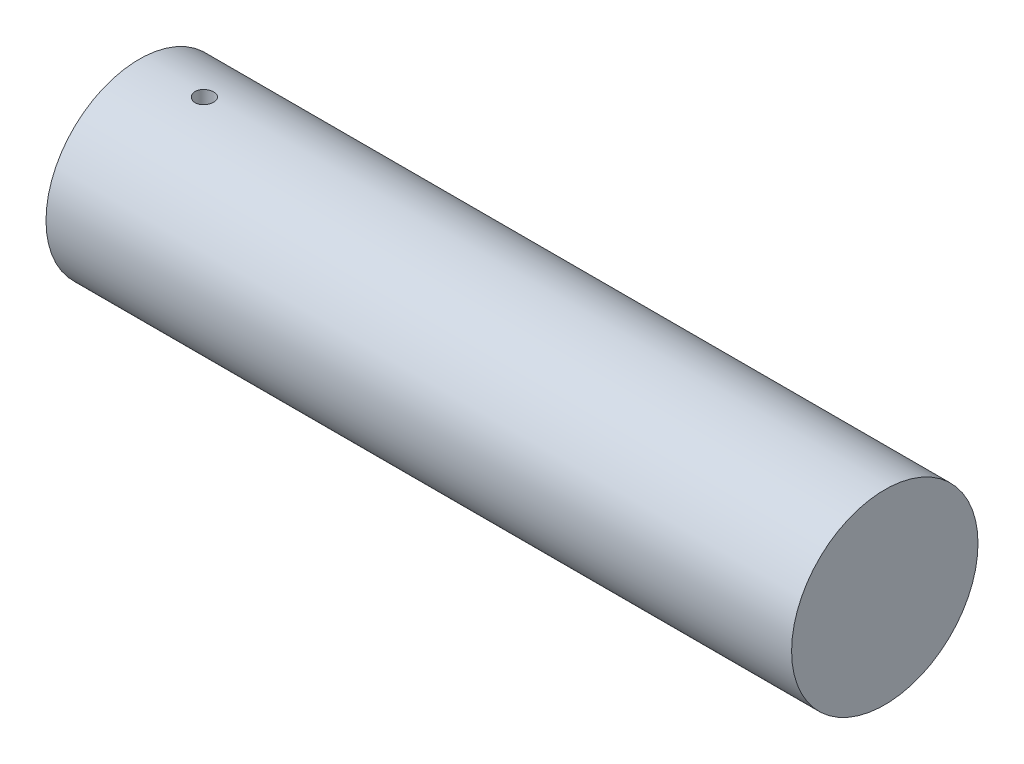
ISO-10303-21;
HEADER;
FILE_DESCRIPTION(('STEP AP214'),'2;1');
FILE_NAME('part.step','',(''),(''),'','','');
FILE_SCHEMA(('AUTOMOTIVE_DESIGN { 1 0 10303 214 1 1 1 1 }'));
ENDSEC;
DATA;
#1=APPLICATION_CONTEXT('core data for automotive mechanical design processes');
#2=APPLICATION_PROTOCOL_DEFINITION('international standard','automotive_design',2000,#1);
#3=PRODUCT_CONTEXT('',#1,'mechanical');
#4=PRODUCT('Part','Part','',(#3));
#5=PRODUCT_RELATED_PRODUCT_CATEGORY('part','',(#4));
#6=PRODUCT_DEFINITION_FORMATION('','',#4);
#7=PRODUCT_DEFINITION_CONTEXT('part definition',#1,'design');
#8=PRODUCT_DEFINITION('design','',#6,#7);
#9=PRODUCT_DEFINITION_SHAPE('','',#8);
#10=(LENGTH_UNIT() NAMED_UNIT(*) SI_UNIT(.MILLI.,.METRE.));
#11=(NAMED_UNIT(*) PLANE_ANGLE_UNIT() SI_UNIT($,.RADIAN.));
#12=(NAMED_UNIT(*) SI_UNIT($,.STERADIAN.) SOLID_ANGLE_UNIT());
#13=UNCERTAINTY_MEASURE_WITH_UNIT(LENGTH_MEASURE(1.E-05),#10,'distance_accuracy_value','');
#14=(GEOMETRIC_REPRESENTATION_CONTEXT(3) GLOBAL_UNCERTAINTY_ASSIGNED_CONTEXT((#13)) GLOBAL_UNIT_ASSIGNED_CONTEXT((#10,
#11,#12)) REPRESENTATION_CONTEXT('',''));
#15=CARTESIAN_POINT('',(0.,0.,0.));
#16=DIRECTION('',(0.,0.,1.));
#17=DIRECTION('',(1.,0.,0.));
#18=AXIS2_PLACEMENT_3D('',#15,#16,#17);
#19=CARTESIAN_POINT('',(3.5,-20.,0.));
#20=DIRECTION('',(0.,1.,0.));
#21=DIRECTION('',(0.,0.,1.));
#22=AXIS2_PLACEMENT_3D('',#19,#20,#21);
#23=CYLINDRICAL_SURFACE('',#22,0.500000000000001);
#24=CARTESIAN_POINT('',(3.5,-1.14564392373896,0.500000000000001));
#25=CARTESIAN_POINT('',(3.52678487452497,-1.14564662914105,0.499997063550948));
#26=CARTESIAN_POINT('',(3.55360763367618,-1.14659650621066,0.497834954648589));
#27=CARTESIAN_POINT('',(3.60648370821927,-1.15027728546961,0.489267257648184));
#28=CARTESIAN_POINT('',(3.63253487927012,-1.15301273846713,0.482850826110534));
#29=CARTESIAN_POINT('',(3.68301323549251,-1.15990113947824,0.466058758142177));
#30=CARTESIAN_POINT('',(3.70744613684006,-1.16404874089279,0.455698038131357));
#31=CARTESIAN_POINT('',(3.7542212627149,-1.1732866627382,0.431355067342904));
#32=CARTESIAN_POINT('',(3.77656394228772,-1.17837677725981,0.417373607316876));
#33=CARTESIAN_POINT('',(3.81981510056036,-1.18925216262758,0.385330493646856));
#34=CARTESIAN_POINT('',(3.84058910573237,-1.19505979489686,0.367094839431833));
#35=CARTESIAN_POINT('',(3.87888224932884,-1.20653114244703,0.327427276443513));
#36=CARTESIAN_POINT('',(3.89640025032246,-1.21219480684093,0.305994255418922));
#37=CARTESIAN_POINT('',(3.92835159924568,-1.22300851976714,0.259501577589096));
#38=CARTESIAN_POINT('',(3.94263607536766,-1.22812950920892,0.234332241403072));
#39=CARTESIAN_POINT('',(3.96671089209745,-1.23700981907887,0.181706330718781));
#40=CARTESIAN_POINT('',(3.97650306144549,-1.24076969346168,0.154250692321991));
#41=CARTESIAN_POINT('',(3.99083537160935,-1.24634581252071,0.0992416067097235));
#42=CARTESIAN_POINT('',(3.99560682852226,-1.24824734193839,0.0717572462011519));
#43=CARTESIAN_POINT('',(4.00050712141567,-1.25020077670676,0.0163165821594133));
#44=CARTESIAN_POINT('',(4.00063768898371,-1.25025337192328,-0.0116395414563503));
#45=CARTESIAN_POINT('',(3.99637930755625,-1.24855490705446,-0.0655581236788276));
#46=CARTESIAN_POINT('',(3.99224380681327,-1.24690499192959,-0.0915443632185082));
#47=CARTESIAN_POINT('',(3.98000178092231,-1.24212322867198,-0.142418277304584));
#48=CARTESIAN_POINT('',(3.9718949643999,-1.23899127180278,-0.16730587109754));
#49=CARTESIAN_POINT('',(3.95184087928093,-1.23149206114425,-0.215724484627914));
#50=CARTESIAN_POINT('',(3.93983757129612,-1.227106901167,-0.239229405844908));
#51=CARTESIAN_POINT('',(3.91238374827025,-1.21753646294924,-0.283952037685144));
#52=CARTESIAN_POINT('',(3.8969320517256,-1.21235091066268,-0.305168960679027));
#53=CARTESIAN_POINT('',(3.86183771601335,-1.20130409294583,-0.346192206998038));
#54=CARTESIAN_POINT('',(3.84198652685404,-1.1954208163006,-0.365814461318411));
#55=CARTESIAN_POINT('',(3.79925235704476,-1.18390415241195,-0.401526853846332));
#56=CARTESIAN_POINT('',(3.77636838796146,-1.17827084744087,-0.417615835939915));
#57=CARTESIAN_POINT('',(3.72739524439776,-1.16774224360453,-0.446226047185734));
#58=CARTESIAN_POINT('',(3.70123379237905,-1.16287228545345,-0.458633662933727));
#59=CARTESIAN_POINT('',(3.6469461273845,-1.15471897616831,-0.478794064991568));
#60=CARTESIAN_POINT('',(3.61882120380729,-1.15143459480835,-0.486549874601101));
#61=CARTESIAN_POINT('',(3.56324105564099,-1.14707439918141,-0.496738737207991));
#62=CARTESIAN_POINT('',(3.53584988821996,-1.14587591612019,-0.499468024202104));
#63=CARTESIAN_POINT('',(3.48098069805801,-1.14547374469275,-0.500390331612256));
#64=CARTESIAN_POINT('',(3.45350270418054,-1.14626945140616,-0.498584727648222));
#65=CARTESIAN_POINT('',(3.40088526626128,-1.14964011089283,-0.490758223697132));
#66=CARTESIAN_POINT('',(3.37570176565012,-1.15211114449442,-0.484983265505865));
#67=CARTESIAN_POINT('',(3.3266778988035,-1.15842512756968,-0.46970104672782));
#68=CARTESIAN_POINT('',(3.30283783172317,-1.16226838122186,-0.460192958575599));
#69=CARTESIAN_POINT('',(3.25609941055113,-1.17108445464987,-0.437283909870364));
#70=CARTESIAN_POINT('',(3.23327845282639,-1.17609676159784,-0.42374071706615));
#71=CARTESIAN_POINT('',(3.19012925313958,-1.18662596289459,-0.39329130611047));
#72=CARTESIAN_POINT('',(3.1698020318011,-1.19214306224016,-0.376383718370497));
#73=CARTESIAN_POINT('',(3.1306566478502,-1.20355228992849,-0.338211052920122));
#74=CARTESIAN_POINT('',(3.11206085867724,-1.20944201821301,-0.316716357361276));
#75=CARTESIAN_POINT('',(3.07870573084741,-1.22054948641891,-0.270770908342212));
#76=CARTESIAN_POINT('',(3.06394654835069,-1.2257671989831,-0.246320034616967));
#77=CARTESIAN_POINT('',(3.03873809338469,-1.23495928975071,-0.195069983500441));
#78=CARTESIAN_POINT('',(3.02828778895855,-1.23893396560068,-0.168271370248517));
#79=CARTESIAN_POINT('',(3.01211278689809,-1.24518178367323,-0.113098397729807));
#80=CARTESIAN_POINT('',(3.00638552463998,-1.24745584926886,-0.0847249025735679));
#81=CARTESIAN_POINT('',(3.00012382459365,-1.24994752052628,-0.0292041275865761));
#82=CARTESIAN_POINT('',(2.99927496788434,-1.25028961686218,-0.00209762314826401));
#83=CARTESIAN_POINT('',(3.00196386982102,-1.24921510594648,0.0518584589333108));
#84=CARTESIAN_POINT('',(3.0055009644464,-1.24779876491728,0.0787080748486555));
#85=CARTESIAN_POINT('',(3.01663669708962,-1.24342878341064,0.130542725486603));
#86=CARTESIAN_POINT('',(3.02410723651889,-1.24052370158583,0.155559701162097));
#87=CARTESIAN_POINT('',(3.04276320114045,-1.23348736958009,0.203980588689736));
#88=CARTESIAN_POINT('',(3.05394931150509,-1.22935589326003,0.227384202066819));
#89=CARTESIAN_POINT('',(3.08027579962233,-1.22004523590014,0.273050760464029));
#90=CARTESIAN_POINT('',(3.09556907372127,-1.21482782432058,0.295217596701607));
#91=CARTESIAN_POINT('',(3.12944712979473,-1.20397350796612,0.336763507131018));
#92=CARTESIAN_POINT('',(3.14803327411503,-1.19833643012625,0.356141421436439));
#93=CARTESIAN_POINT('',(3.18932880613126,-1.18684440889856,0.392800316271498));
#94=CARTESIAN_POINT('',(3.21222221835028,-1.18099758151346,0.409877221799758));
#95=CARTESIAN_POINT('',(3.26073553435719,-1.17012417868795,0.43996186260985));
#96=CARTESIAN_POINT('',(3.28635575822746,-1.16509769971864,0.452969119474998));
#97=CARTESIAN_POINT('',(3.33725930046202,-1.15689716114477,0.473497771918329));
#98=CARTESIAN_POINT('',(3.36236630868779,-1.15359729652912,0.481406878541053));
#99=CARTESIAN_POINT('',(3.41362135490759,-1.14861500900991,0.493179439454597));
#100=CARTESIAN_POINT('',(3.43976627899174,-1.14692808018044,0.497054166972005));
#101=CARTESIAN_POINT('',(3.47734439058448,-1.14581114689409,0.499616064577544));
#102=CARTESIAN_POINT('',(3.4886688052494,-1.14564277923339,0.500001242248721));
#103=CARTESIAN_POINT('',(3.5,-1.14564392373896,0.500000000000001));
#104=B_SPLINE_CURVE_WITH_KNOTS('',3,(#24,#25,#26,#27,#28,#29,#30,#31,#32,#33,#34,#35,#36,#37,
#38,#39,#40,#41,#42,#43,#44,#45,#46,#47,#48,#49,#50,#51,#52,#53,#54,#55,#56,#57,#58,#59,#60,#61,
#62,#63,#64,#65,#66,#67,#68,#69,#70,#71,#72,#73,#74,#75,#76,#77,#78,#79,#80,#81,#82,#83,#84,#85,
#86,#87,#88,#89,#90,#91,#92,#93,#94,#95,#96,#97,#98,#99,#100,#101,#102,#103),.UNSPECIFIED.,.T.,
.F.,(4,2,2,2,2,2,2,2,2,2,2,2,2,2,2,2,2,2,2,2,2,2,2,2,2,2,2,2,2,2,2,2,2,2,2,2,2,2,2,4),(0.,
0.0803194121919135,0.160844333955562,0.241067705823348,0.321273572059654,0.405639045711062,
0.490033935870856,0.577756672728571,0.665443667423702,0.74888545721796,0.832296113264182,
0.911021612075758,0.989752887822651,1.06967075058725,1.14961603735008,1.23481011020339,
1.32003201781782,1.40766114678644,1.49523326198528,1.57745536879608,1.65965253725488,
1.73716812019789,1.81470089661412,1.89537788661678,1.97608778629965,2.06275933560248,
2.1494344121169,2.23608871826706,2.32269593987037,2.40365259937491,2.48459700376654,
2.56305498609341,2.64152744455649,2.72346762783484,2.80544179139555,2.89249063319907,
2.979549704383,3.05879165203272,3.13781157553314,3.17179026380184),.UNSPECIFIED.);
#105=CARTESIAN_POINT('',(3.5,-1.14564392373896,0.500000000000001));
#106=VERTEX_POINT('',#105);
#107=EDGE_CURVE('E40',#106,#106,#104,.T.);
#108=ORIENTED_EDGE('',*,*,#107,.T.);
#109=EDGE_LOOP('',(#108));
#110=FACE_BOUND('',#109,.T.);
#111=CARTESIAN_POINT('',(3.5,-4.9749371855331,0.500000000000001));
#112=CARTESIAN_POINT('',(3.5280097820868,-4.97493751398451,0.499998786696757));
#113=CARTESIAN_POINT('',(3.55603808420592,-4.97517628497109,0.497638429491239));
#114=CARTESIAN_POINT('',(3.61131759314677,-4.9761054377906,0.488258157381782));
#115=CARTESIAN_POINT('',(3.63856790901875,-4.9767963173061,0.481233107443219));
#116=CARTESIAN_POINT('',(3.69148290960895,-4.97855066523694,0.462730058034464));
#117=CARTESIAN_POINT('',(3.71714854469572,-4.97961390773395,0.45125475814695));
#118=CARTESIAN_POINT('',(3.76618389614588,-4.9819929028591,0.424182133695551));
#119=CARTESIAN_POINT('',(3.78955406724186,-4.98330860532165,0.408585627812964));
#120=CARTESIAN_POINT('',(3.83342563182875,-4.98604963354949,0.373652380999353));
#121=CARTESIAN_POINT('',(3.85391750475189,-4.98747530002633,0.35430370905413));
#122=CARTESIAN_POINT('',(3.89136880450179,-4.99027252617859,0.312440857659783));
#123=CARTESIAN_POINT('',(3.90832806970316,-4.99164408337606,0.289926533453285));
#124=CARTESIAN_POINT('',(3.93826562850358,-4.99418191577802,0.242313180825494));
#125=CARTESIAN_POINT('',(3.95123549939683,-4.99534775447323,0.217208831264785));
#126=CARTESIAN_POINT('',(3.97277221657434,-4.99733908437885,0.165164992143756));
#127=CARTESIAN_POINT('',(3.98133917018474,-4.99816458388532,0.13822554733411));
#128=CARTESIAN_POINT('',(3.99379895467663,-4.99937983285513,0.0833723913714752));
#129=CARTESIAN_POINT('',(3.99770741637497,-4.99977103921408,0.055462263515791));
#130=CARTESIAN_POINT('',(4.00078763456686,-5.00007857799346,-0.000620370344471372));
#131=CARTESIAN_POINT('',(3.99995951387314,-4.99999492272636,-0.0287928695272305));
#132=CARTESIAN_POINT('',(3.99360276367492,-4.99936335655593,-0.0844944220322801));
#133=CARTESIAN_POINT('',(3.98809094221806,-4.99881710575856,-0.11202541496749));
#134=CARTESIAN_POINT('',(3.97254943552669,-4.99732364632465,-0.165769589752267));
#135=CARTESIAN_POINT('',(3.96251969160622,-4.99637643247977,-0.191982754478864));
#136=CARTESIAN_POINT('',(3.93820861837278,-4.99418468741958,-0.242400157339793));
#137=CARTESIAN_POINT('',(3.92391985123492,-4.99293963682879,-0.266600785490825));
#138=CARTESIAN_POINT('',(3.89150173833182,-4.99029192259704,-0.312266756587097));
#139=CARTESIAN_POINT('',(3.87337227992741,-4.98888925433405,-0.333732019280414));
#140=CARTESIAN_POINT('',(3.83369288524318,-4.98607646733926,-0.373416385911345));
#141=CARTESIAN_POINT('',(3.81212832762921,-4.98466634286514,-0.391620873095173));
#142=CARTESIAN_POINT('',(3.76624156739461,-4.98200369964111,-0.42415376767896));
#143=CARTESIAN_POINT('',(3.74191936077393,-4.98075118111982,-0.438482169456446));
#144=CARTESIAN_POINT('',(3.69119648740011,-4.97854544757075,-0.462856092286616));
#145=CARTESIAN_POINT('',(3.66479538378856,-4.97759229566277,-0.472900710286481));
#146=CARTESIAN_POINT('',(3.61066969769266,-4.97609450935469,-0.488410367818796));
#147=CARTESIAN_POINT('',(3.58294515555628,-4.97554986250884,-0.493875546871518));
#148=CARTESIAN_POINT('',(3.52708791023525,-4.97493290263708,-0.500052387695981));
#149=CARTESIAN_POINT('',(3.49895748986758,-4.97485855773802,-0.500784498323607));
#150=CARTESIAN_POINT('',(3.44297436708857,-4.97518525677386,-0.497528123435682));
#151=CARTESIAN_POINT('',(3.41512166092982,-4.97558629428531,-0.493539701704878));
#152=CARTESIAN_POINT('',(3.36054420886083,-4.97681672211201,-0.480972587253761));
#153=CARTESIAN_POINT('',(3.33381721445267,-4.97764521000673,-0.472403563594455));
#154=CARTESIAN_POINT('',(3.28217997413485,-4.97963645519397,-0.45092835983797));
#155=CARTESIAN_POINT('',(3.25726976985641,-4.98079922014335,-0.438022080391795));
#156=CARTESIAN_POINT('',(3.20988001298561,-4.98333292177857,-0.408187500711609));
#157=CARTESIAN_POINT('',(3.18740902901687,-4.98470455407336,-0.391245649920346));
#158=CARTESIAN_POINT('',(3.14562247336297,-4.98749916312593,-0.353840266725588));
#159=CARTESIAN_POINT('',(3.12630697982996,-4.98892214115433,-0.333376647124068));
#160=CARTESIAN_POINT('',(3.09130918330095,-4.99166523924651,-0.289419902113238));
#161=CARTESIAN_POINT('',(3.07564022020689,-4.99298497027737,-0.265916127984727));
#162=CARTESIAN_POINT('',(3.04847206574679,-4.99536721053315,-0.216598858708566));
#163=CARTESIAN_POINT('',(3.03697281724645,-4.99642972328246,-0.190785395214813));
#164=CARTESIAN_POINT('',(3.01849311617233,-4.99817605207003,-0.137628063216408));
#165=CARTESIAN_POINT('',(3.01150460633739,-4.99886054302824,-0.11028701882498));
#166=CARTESIAN_POINT('',(3.00221846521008,-4.99977647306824,-0.0548124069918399));
#167=CARTESIAN_POINT('',(2.99992070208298,-5.00000792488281,-0.0266788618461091));
#168=CARTESIAN_POINT('',(3.00008313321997,-4.99999169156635,0.0294511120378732));
#169=CARTESIAN_POINT('',(3.00252261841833,-4.99974609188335,0.0574476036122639));
#170=CARTESIAN_POINT('',(3.01204687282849,-4.99880746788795,0.112630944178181));
#171=CARTESIAN_POINT('',(3.01913164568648,-4.99811444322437,0.139817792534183));
#172=CARTESIAN_POINT('',(3.03773962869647,-4.99635861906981,0.192609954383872));
#173=CARTESIAN_POINT('',(3.04926223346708,-4.99529587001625,0.218215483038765));
#174=CARTESIAN_POINT('',(3.07641658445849,-4.99291906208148,0.267132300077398));
#175=CARTESIAN_POINT('',(3.09204830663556,-4.99160500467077,0.29044360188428));
#176=CARTESIAN_POINT('',(3.12705480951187,-4.98886592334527,0.33421636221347));
#177=CARTESIAN_POINT('',(3.1464450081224,-4.9874404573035,0.354665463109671));
#178=CARTESIAN_POINT('',(3.18838767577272,-4.98464295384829,0.392028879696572));
#179=CARTESIAN_POINT('',(3.21094090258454,-4.98327092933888,0.408942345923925));
#180=CARTESIAN_POINT('',(3.25863217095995,-4.980731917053,0.438788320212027));
#181=CARTESIAN_POINT('',(3.28377664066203,-4.97956545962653,0.451710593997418));
#182=CARTESIAN_POINT('',(3.33587414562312,-4.97757597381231,0.473132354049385));
#183=CARTESIAN_POINT('',(3.36282510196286,-4.9767525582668,0.48163682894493));
#184=CARTESIAN_POINT('',(3.40827387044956,-4.97575003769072,0.491860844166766));
#185=CARTESIAN_POINT('',(3.42648112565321,-4.97544665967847,0.494908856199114));
#186=CARTESIAN_POINT('',(3.46312291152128,-4.97504012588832,0.498978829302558));
#187=CARTESIAN_POINT('',(3.4815574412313,-4.97493696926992,0.500000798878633));
#188=CARTESIAN_POINT('',(3.5,-4.9749371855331,0.500000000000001));
#189=B_SPLINE_CURVE_WITH_KNOTS('',3,(#111,#112,#113,#114,#115,#116,#117,#118,#119,#120,#121,
#122,#123,#124,#125,#126,#127,#128,#129,#130,#131,#132,#133,#134,#135,#136,#137,#138,#139,#140,
#141,#142,#143,#144,#145,#146,#147,#148,#149,#150,#151,#152,#153,#154,#155,#156,#157,#158,#159,
#160,#161,#162,#163,#164,#165,#166,#167,#168,#169,#170,#171,#172,#173,#174,#175,#176,#177,#178,
#179,#180,#181,#182,#183,#184,#185,#186,#187,#188),.UNSPECIFIED.,.T.,.F.,(4,2,2,2,2,2,2,2,2,2,2,
2,2,2,2,2,2,2,2,2,2,2,2,2,2,2,2,2,2,2,2,2,2,2,2,2,2,2,4),(0.,0.0839619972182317,
0.168016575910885,0.252020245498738,0.336007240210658,0.420265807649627,0.504528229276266,
0.58896734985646,0.673404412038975,0.757557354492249,0.841708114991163,0.92555815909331,
1.00940929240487,1.09340772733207,1.17740862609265,1.26177712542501,1.34614574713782,
1.43053214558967,1.51491597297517,1.59893498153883,1.68295285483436,1.76679407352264,
1.85063721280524,1.93476594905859,2.01889676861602,2.1033306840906,2.18776344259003,
2.27204496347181,2.35632411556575,2.44023566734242,2.5241472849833,2.60804745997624,
2.691947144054,2.77619857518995,2.86047022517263,2.94495620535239,3.02934657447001,
3.08463013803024,3.13991346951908),.UNSPECIFIED.);
#190=CARTESIAN_POINT('',(3.5,-4.9749371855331,0.500000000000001));
#191=VERTEX_POINT('',#190);
#192=EDGE_CURVE('E54',#191,#191,#189,.T.);
#193=ORIENTED_EDGE('',*,*,#192,.F.);
#194=EDGE_LOOP('',(#193));
#195=FACE_BOUND('',#194,.T.);
#196=ADVANCED_FACE('F35',(#110,#195),#23,.F.);
#197=CARTESIAN_POINT('',(40.,0.,0.));
#198=DIRECTION('',(-1.,0.,0.));
#199=DIRECTION('',(0.,0.,1.));
#200=AXIS2_PLACEMENT_3D('',#197,#198,#199);
#201=CYLINDRICAL_SURFACE('',#200,5.);
#202=ORIENTED_EDGE('',*,*,#192,.T.);
#203=EDGE_LOOP('',(#202));
#204=FACE_BOUND('',#203,.T.);
#205=CARTESIAN_POINT('',(3.5,4.9749371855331,0.500000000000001));
#206=CARTESIAN_POINT('',(3.4719902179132,4.97493751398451,0.499998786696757));
#207=CARTESIAN_POINT('',(3.44396191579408,4.97517628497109,0.497638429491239));
#208=CARTESIAN_POINT('',(3.38868240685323,4.9761054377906,0.488258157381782));
#209=CARTESIAN_POINT('',(3.36143209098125,4.9767963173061,0.481233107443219));
#210=CARTESIAN_POINT('',(3.30851709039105,4.97855066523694,0.462730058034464));
#211=CARTESIAN_POINT('',(3.28285145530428,4.97961390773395,0.45125475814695));
#212=CARTESIAN_POINT('',(3.23381610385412,4.9819929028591,0.424182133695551));
#213=CARTESIAN_POINT('',(3.21044593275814,4.98330860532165,0.408585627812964));
#214=CARTESIAN_POINT('',(3.16657436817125,4.98604963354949,0.373652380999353));
#215=CARTESIAN_POINT('',(3.14608249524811,4.98747530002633,0.35430370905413));
#216=CARTESIAN_POINT('',(3.10863119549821,4.99027252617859,0.312440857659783));
#217=CARTESIAN_POINT('',(3.09167193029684,4.99164408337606,0.289926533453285));
#218=CARTESIAN_POINT('',(3.06173437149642,4.99418191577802,0.242313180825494));
#219=CARTESIAN_POINT('',(3.04876450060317,4.99534775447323,0.217208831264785));
#220=CARTESIAN_POINT('',(3.02722778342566,4.99733908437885,0.165164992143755));
#221=CARTESIAN_POINT('',(3.01866082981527,4.99816458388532,0.13822554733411));
#222=CARTESIAN_POINT('',(3.00620104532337,4.99937983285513,0.0833723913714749));
#223=CARTESIAN_POINT('',(3.00229258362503,4.99977103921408,0.0554622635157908));
#224=CARTESIAN_POINT('',(2.99921236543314,5.00007857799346,-0.000620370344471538));
#225=CARTESIAN_POINT('',(3.00004048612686,4.99999492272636,-0.0287928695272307));
#226=CARTESIAN_POINT('',(3.00639723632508,4.99936335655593,-0.0844944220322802));
#227=CARTESIAN_POINT('',(3.01190905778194,4.99881710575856,-0.11202541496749));
#228=CARTESIAN_POINT('',(3.02745056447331,4.99732364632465,-0.165769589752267));
#229=CARTESIAN_POINT('',(3.03748030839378,4.99637643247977,-0.191982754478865));
#230=CARTESIAN_POINT('',(3.06179138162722,4.99418468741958,-0.242400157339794));
#231=CARTESIAN_POINT('',(3.07608014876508,4.99293963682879,-0.266600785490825));
#232=CARTESIAN_POINT('',(3.10849826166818,4.99029192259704,-0.312266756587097));
#233=CARTESIAN_POINT('',(3.12662772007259,4.98888925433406,-0.333732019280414));
#234=CARTESIAN_POINT('',(3.16630711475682,4.98607646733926,-0.373416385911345));
#235=CARTESIAN_POINT('',(3.18787167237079,4.98466634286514,-0.391620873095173));
#236=CARTESIAN_POINT('',(3.23375843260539,4.98200369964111,-0.42415376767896));
#237=CARTESIAN_POINT('',(3.25808063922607,4.98075118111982,-0.438482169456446));
#238=CARTESIAN_POINT('',(3.30880351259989,4.97854544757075,-0.462856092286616));
#239=CARTESIAN_POINT('',(3.33520461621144,4.97759229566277,-0.472900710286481));
#240=CARTESIAN_POINT('',(3.38933030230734,4.97609450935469,-0.488410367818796));
#241=CARTESIAN_POINT('',(3.41705484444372,4.97554986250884,-0.493875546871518));
#242=CARTESIAN_POINT('',(3.47291208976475,4.97493290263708,-0.500052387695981));
#243=CARTESIAN_POINT('',(3.50104251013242,4.97485855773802,-0.500784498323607));
#244=CARTESIAN_POINT('',(3.55702563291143,4.97518525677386,-0.497528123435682));
#245=CARTESIAN_POINT('',(3.58487833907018,4.97558629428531,-0.493539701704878));
#246=CARTESIAN_POINT('',(3.63945579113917,4.97681672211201,-0.480972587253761));
#247=CARTESIAN_POINT('',(3.66618278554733,4.97764521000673,-0.472403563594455));
#248=CARTESIAN_POINT('',(3.71782002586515,4.97963645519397,-0.450928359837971));
#249=CARTESIAN_POINT('',(3.74273023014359,4.98079922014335,-0.438022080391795));
#250=CARTESIAN_POINT('',(3.79011998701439,4.98333292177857,-0.40818750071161));
#251=CARTESIAN_POINT('',(3.81259097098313,4.98470455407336,-0.391245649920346));
#252=CARTESIAN_POINT('',(3.85437752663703,4.98749916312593,-0.353840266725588));
#253=CARTESIAN_POINT('',(3.87369302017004,4.98892214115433,-0.333376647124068));
#254=CARTESIAN_POINT('',(3.90869081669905,4.99166523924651,-0.289419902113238));
#255=CARTESIAN_POINT('',(3.92435977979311,4.99298497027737,-0.265916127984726));
#256=CARTESIAN_POINT('',(3.95152793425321,4.99536721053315,-0.216598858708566));
#257=CARTESIAN_POINT('',(3.96302718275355,4.99642972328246,-0.190785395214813));
#258=CARTESIAN_POINT('',(3.98150688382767,4.99817605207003,-0.137628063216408));
#259=CARTESIAN_POINT('',(3.98849539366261,4.99886054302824,-0.11028701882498));
#260=CARTESIAN_POINT('',(3.99778153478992,4.99977647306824,-0.0548124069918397));
#261=CARTESIAN_POINT('',(4.00007929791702,5.00000792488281,-0.0266788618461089));
#262=CARTESIAN_POINT('',(3.99991686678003,4.99999169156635,0.0294511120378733));
#263=CARTESIAN_POINT('',(3.99747738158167,4.99974609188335,0.057447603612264));
#264=CARTESIAN_POINT('',(3.98795312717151,4.99880746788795,0.112630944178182));
#265=CARTESIAN_POINT('',(3.98086835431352,4.99811444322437,0.139817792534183));
#266=CARTESIAN_POINT('',(3.96226037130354,4.99635861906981,0.192609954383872));
#267=CARTESIAN_POINT('',(3.95073776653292,4.99529587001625,0.218215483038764));
#268=CARTESIAN_POINT('',(3.92358341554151,4.99291906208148,0.267132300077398));
#269=CARTESIAN_POINT('',(3.90795169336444,4.99160500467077,0.29044360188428));
#270=CARTESIAN_POINT('',(3.87294519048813,4.98886592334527,0.33421636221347));
#271=CARTESIAN_POINT('',(3.8535549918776,4.9874404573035,0.354665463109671));
#272=CARTESIAN_POINT('',(3.81161232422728,4.98464295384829,0.392028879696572));
#273=CARTESIAN_POINT('',(3.78905909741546,4.98327092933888,0.408942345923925));
#274=CARTESIAN_POINT('',(3.74136782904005,4.980731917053,0.438788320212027));
#275=CARTESIAN_POINT('',(3.71622335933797,4.97956545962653,0.451710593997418));
#276=CARTESIAN_POINT('',(3.66412585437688,4.97757597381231,0.473132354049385));
#277=CARTESIAN_POINT('',(3.63717489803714,4.9767525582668,0.48163682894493));
#278=CARTESIAN_POINT('',(3.59172612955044,4.97575003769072,0.491860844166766));
#279=CARTESIAN_POINT('',(3.57351887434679,4.97544665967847,0.494908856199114));
#280=CARTESIAN_POINT('',(3.53687708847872,4.97504012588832,0.498978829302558));
#281=CARTESIAN_POINT('',(3.5184425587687,4.97493696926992,0.500000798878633));
#282=CARTESIAN_POINT('',(3.5,4.9749371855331,0.500000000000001));
#283=B_SPLINE_CURVE_WITH_KNOTS('',3,(#205,#206,#207,#208,#209,#210,#211,#212,#213,#214,#215,
#216,#217,#218,#219,#220,#221,#222,#223,#224,#225,#226,#227,#228,#229,#230,#231,#232,#233,#234,
#235,#236,#237,#238,#239,#240,#241,#242,#243,#244,#245,#246,#247,#248,#249,#250,#251,#252,#253,
#254,#255,#256,#257,#258,#259,#260,#261,#262,#263,#264,#265,#266,#267,#268,#269,#270,#271,#272,
#273,#274,#275,#276,#277,#278,#279,#280,#281,#282),.UNSPECIFIED.,.T.,.F.,(4,2,2,2,2,2,2,2,2,2,2,
2,2,2,2,2,2,2,2,2,2,2,2,2,2,2,2,2,2,2,2,2,2,2,2,2,2,2,4),(0.,0.0839619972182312,
0.168016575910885,0.252020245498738,0.336007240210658,0.420265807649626,0.504528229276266,
0.58896734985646,0.673404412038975,0.757557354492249,0.841708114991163,0.925558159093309,
1.00940929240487,1.09340772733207,1.17740862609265,1.26177712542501,1.34614574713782,
1.43053214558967,1.51491597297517,1.59893498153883,1.68295285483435,1.76679407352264,
1.85063721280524,1.93476594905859,2.01889676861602,2.1033306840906,2.18776344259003,
2.27204496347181,2.35632411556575,2.44023566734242,2.5241472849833,2.60804745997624,
2.691947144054,2.77619857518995,2.86047022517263,2.94495620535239,3.02934657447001,
3.08463013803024,3.13991346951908),.UNSPECIFIED.);
#284=CARTESIAN_POINT('',(3.5,4.9749371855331,0.500000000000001));
#285=VERTEX_POINT('',#284);
#286=EDGE_CURVE('E60',#285,#285,#283,.T.);
#287=ORIENTED_EDGE('',*,*,#286,.T.);
#288=EDGE_LOOP('',(#287));
#289=FACE_BOUND('',#288,.T.);
#290=CARTESIAN_POINT('',(40.,0.,0.));
#291=DIRECTION('',(1.,0.,0.));
#292=DIRECTION('',(0.,0.,-1.));
#293=AXIS2_PLACEMENT_3D('',#290,#291,#292);
#294=CIRCLE('',#293,5.);
#295=CARTESIAN_POINT('',(40.,0.,-5.));
#296=VERTEX_POINT('',#295);
#297=EDGE_CURVE('E10',#296,#296,#294,.T.);
#298=ORIENTED_EDGE('',*,*,#297,.F.);
#299=EDGE_LOOP('',(#298));
#300=FACE_BOUND('',#299,.T.);
#301=CARTESIAN_POINT('',(0.,0.,0.));
#302=DIRECTION('',(1.,0.,0.));
#303=DIRECTION('',(0.,0.,-1.));
#304=AXIS2_PLACEMENT_3D('',#301,#302,#303);
#305=CIRCLE('',#304,5.);
#306=CARTESIAN_POINT('',(0.,0.,-5.));
#307=VERTEX_POINT('',#306);
#308=EDGE_CURVE('E49',#307,#307,#305,.T.);
#309=ORIENTED_EDGE('',*,*,#308,.T.);
#310=EDGE_LOOP('',(#309));
#311=FACE_BOUND('',#310,.T.);
#312=ADVANCED_FACE('F37',(#204,#289,#300,#311),#201,.T.);
#313=CARTESIAN_POINT('',(40.,0.,0.));
#314=DIRECTION('',(1.,0.,0.));
#315=DIRECTION('',(0.,0.,-1.));
#316=AXIS2_PLACEMENT_3D('',#313,#314,#315);
#317=PLANE('',#316);
#318=ORIENTED_EDGE('',*,*,#297,.T.);
#319=EDGE_LOOP('',(#318));
#320=FACE_BOUND('',#319,.T.);
#321=ADVANCED_FACE('F78',(#320),#317,.T.);
#322=CARTESIAN_POINT('',(0.,0.,0.));
#323=DIRECTION('',(1.,0.,0.));
#324=DIRECTION('',(0.,0.,-1.));
#325=AXIS2_PLACEMENT_3D('',#322,#323,#324);
#326=PLANE('',#325);
#327=CARTESIAN_POINT('',(0.,0.,0.));
#328=DIRECTION('',(-1.,0.,0.));
#329=DIRECTION('',(0.,0.,1.));
#330=AXIS2_PLACEMENT_3D('',#327,#328,#329);
#331=CIRCLE('',#330,1.25);
#332=CARTESIAN_POINT('',(0.,0.,1.25));
#333=VERTEX_POINT('',#332);
#334=EDGE_CURVE('E57',#333,#333,#331,.T.);
#335=ORIENTED_EDGE('',*,*,#334,.F.);
#336=EDGE_LOOP('',(#335));
#337=FACE_BOUND('',#336,.T.);
#338=ORIENTED_EDGE('',*,*,#308,.F.);
#339=EDGE_LOOP('',(#338));
#340=FACE_BOUND('',#339,.T.);
#341=ADVANCED_FACE('F74',(#337,#340),#326,.F.);
#342=CARTESIAN_POINT('',(3.5,1.14564392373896,0.500000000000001));
#343=CARTESIAN_POINT('',(3.47321512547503,1.14564662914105,0.499997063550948));
#344=CARTESIAN_POINT('',(3.44639236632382,1.14659650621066,0.497834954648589));
#345=CARTESIAN_POINT('',(3.39351629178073,1.15027728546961,0.489267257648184));
#346=CARTESIAN_POINT('',(3.36746512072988,1.15301273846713,0.482850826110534));
#347=CARTESIAN_POINT('',(3.31698676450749,1.15990113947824,0.466058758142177));
#348=CARTESIAN_POINT('',(3.29255386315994,1.16404874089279,0.455698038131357));
#349=CARTESIAN_POINT('',(3.2457787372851,1.1732866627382,0.431355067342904));
#350=CARTESIAN_POINT('',(3.22343605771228,1.17837677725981,0.417373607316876));
#351=CARTESIAN_POINT('',(3.18018489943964,1.18925216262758,0.385330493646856));
#352=CARTESIAN_POINT('',(3.15941089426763,1.19505979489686,0.367094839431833));
#353=CARTESIAN_POINT('',(3.12111775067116,1.20653114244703,0.327427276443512));
#354=CARTESIAN_POINT('',(3.10359974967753,1.21219480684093,0.305994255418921));
#355=CARTESIAN_POINT('',(3.07164840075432,1.22300851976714,0.259501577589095));
#356=CARTESIAN_POINT('',(3.05736392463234,1.22812950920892,0.234332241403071));
#357=CARTESIAN_POINT('',(3.03328910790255,1.23700981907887,0.181706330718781));
#358=CARTESIAN_POINT('',(3.02349693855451,1.24076969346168,0.154250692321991));
#359=CARTESIAN_POINT('',(3.00916462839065,1.24634581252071,0.0992416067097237));
#360=CARTESIAN_POINT('',(3.00439317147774,1.24824734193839,0.0717572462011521));
#361=CARTESIAN_POINT('',(2.99949287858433,1.25020077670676,0.0163165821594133));
#362=CARTESIAN_POINT('',(2.99936231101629,1.25025337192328,-0.0116395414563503));
#363=CARTESIAN_POINT('',(3.00362069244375,1.24855490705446,-0.0655581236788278));
#364=CARTESIAN_POINT('',(3.00775619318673,1.24690499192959,-0.0915443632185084));
#365=CARTESIAN_POINT('',(3.01999821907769,1.24212322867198,-0.142418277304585));
#366=CARTESIAN_POINT('',(3.0281050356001,1.23899127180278,-0.16730587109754));
#367=CARTESIAN_POINT('',(3.04815912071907,1.23149206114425,-0.215724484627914));
#368=CARTESIAN_POINT('',(3.06016242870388,1.227106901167,-0.239229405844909));
#369=CARTESIAN_POINT('',(3.08761625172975,1.21753646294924,-0.283952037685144));
#370=CARTESIAN_POINT('',(3.10306794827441,1.21235091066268,-0.305168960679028));
#371=CARTESIAN_POINT('',(3.13816228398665,1.20130409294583,-0.346192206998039));
#372=CARTESIAN_POINT('',(3.15801347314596,1.1954208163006,-0.365814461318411));
#373=CARTESIAN_POINT('',(3.20074764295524,1.18390415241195,-0.401526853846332));
#374=CARTESIAN_POINT('',(3.22363161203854,1.17827084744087,-0.417615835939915));
#375=CARTESIAN_POINT('',(3.27260475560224,1.16774224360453,-0.446226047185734));
#376=CARTESIAN_POINT('',(3.29876620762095,1.16287228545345,-0.458633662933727));
#377=CARTESIAN_POINT('',(3.3530538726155,1.15471897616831,-0.478794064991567));
#378=CARTESIAN_POINT('',(3.38117879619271,1.15143459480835,-0.486549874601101));
#379=CARTESIAN_POINT('',(3.43675894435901,1.14707439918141,-0.496738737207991));
#380=CARTESIAN_POINT('',(3.46415011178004,1.14587591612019,-0.499468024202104));
#381=CARTESIAN_POINT('',(3.51901930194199,1.14547374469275,-0.500390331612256));
#382=CARTESIAN_POINT('',(3.54649729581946,1.14626945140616,-0.498584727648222));
#383=CARTESIAN_POINT('',(3.59911473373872,1.14964011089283,-0.490758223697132));
#384=CARTESIAN_POINT('',(3.62429823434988,1.15211114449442,-0.484983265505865));
#385=CARTESIAN_POINT('',(3.6733221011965,1.15842512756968,-0.46970104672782));
#386=CARTESIAN_POINT('',(3.69716216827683,1.16226838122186,-0.460192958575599));
#387=CARTESIAN_POINT('',(3.74390058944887,1.17108445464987,-0.437283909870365));
#388=CARTESIAN_POINT('',(3.76672154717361,1.17609676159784,-0.42374071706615));
#389=CARTESIAN_POINT('',(3.80987074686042,1.18662596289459,-0.39329130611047));
#390=CARTESIAN_POINT('',(3.8301979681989,1.19214306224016,-0.376383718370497));
#391=CARTESIAN_POINT('',(3.8693433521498,1.20355228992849,-0.338211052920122));
#392=CARTESIAN_POINT('',(3.88793914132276,1.20944201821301,-0.316716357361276));
#393=CARTESIAN_POINT('',(3.92129426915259,1.22054948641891,-0.270770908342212));
#394=CARTESIAN_POINT('',(3.93605345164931,1.2257671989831,-0.246320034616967));
#395=CARTESIAN_POINT('',(3.96126190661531,1.23495928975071,-0.195069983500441));
#396=CARTESIAN_POINT('',(3.97171221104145,1.23893396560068,-0.168271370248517));
#397=CARTESIAN_POINT('',(3.98788721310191,1.24518178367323,-0.113098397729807));
#398=CARTESIAN_POINT('',(3.99361447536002,1.24745584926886,-0.0847249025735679));
#399=CARTESIAN_POINT('',(3.99987617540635,1.24994752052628,-0.0292041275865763));
#400=CARTESIAN_POINT('',(4.00072503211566,1.25028961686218,-0.00209762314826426));
#401=CARTESIAN_POINT('',(3.99803613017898,1.24921510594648,0.0518584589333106));
#402=CARTESIAN_POINT('',(3.9944990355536,1.24779876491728,0.0787080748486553));
#403=CARTESIAN_POINT('',(3.98336330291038,1.24342878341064,0.130542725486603));
#404=CARTESIAN_POINT('',(3.97589276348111,1.24052370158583,0.155559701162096));
#405=CARTESIAN_POINT('',(3.95723679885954,1.23348736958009,0.203980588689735));
#406=CARTESIAN_POINT('',(3.94605068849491,1.22935589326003,0.227384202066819));
#407=CARTESIAN_POINT('',(3.91972420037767,1.22004523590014,0.273050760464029));
#408=CARTESIAN_POINT('',(3.90443092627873,1.21482782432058,0.295217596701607));
#409=CARTESIAN_POINT('',(3.87055287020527,1.20397350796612,0.336763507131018));
#410=CARTESIAN_POINT('',(3.85196672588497,1.19833643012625,0.356141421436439));
#411=CARTESIAN_POINT('',(3.81067119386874,1.18684440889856,0.392800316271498));
#412=CARTESIAN_POINT('',(3.78777778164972,1.18099758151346,0.409877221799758));
#413=CARTESIAN_POINT('',(3.73926446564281,1.17012417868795,0.43996186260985));
#414=CARTESIAN_POINT('',(3.71364424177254,1.16509769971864,0.452969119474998));
#415=CARTESIAN_POINT('',(3.66274069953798,1.15689716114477,0.473497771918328));
#416=CARTESIAN_POINT('',(3.63763369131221,1.15359729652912,0.481406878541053));
#417=CARTESIAN_POINT('',(3.58637864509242,1.14861500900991,0.493179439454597));
#418=CARTESIAN_POINT('',(3.56023372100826,1.14692808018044,0.497054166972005));
#419=CARTESIAN_POINT('',(3.52265560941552,1.14581114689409,0.499616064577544));
#420=CARTESIAN_POINT('',(3.5113311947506,1.14564277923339,0.500001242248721));
#421=CARTESIAN_POINT('',(3.5,1.14564392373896,0.500000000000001));
#422=B_SPLINE_CURVE_WITH_KNOTS('',3,(#342,#343,#344,#345,#346,#347,#348,#349,#350,#351,#352,
#353,#354,#355,#356,#357,#358,#359,#360,#361,#362,#363,#364,#365,#366,#367,#368,#369,#370,#371,
#372,#373,#374,#375,#376,#377,#378,#379,#380,#381,#382,#383,#384,#385,#386,#387,#388,#389,#390,
#391,#392,#393,#394,#395,#396,#397,#398,#399,#400,#401,#402,#403,#404,#405,#406,#407,#408,#409,
#410,#411,#412,#413,#414,#415,#416,#417,#418,#419,#420,#421),.UNSPECIFIED.,.T.,.F.,(4,2,2,2,2,2,
2,2,2,2,2,2,2,2,2,2,2,2,2,2,2,2,2,2,2,2,2,2,2,2,2,2,2,2,2,2,2,2,2,4),(0.,0.0803194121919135,
0.160844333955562,0.241067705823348,0.321273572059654,0.405639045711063,0.490033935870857,
0.577756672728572,0.665443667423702,0.74888545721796,0.832296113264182,0.911021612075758,
0.989752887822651,1.06967075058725,1.14961603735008,1.23481011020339,1.32003201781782,
1.40766114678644,1.49523326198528,1.57745536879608,1.65965253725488,1.73716812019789,
1.81470089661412,1.89537788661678,1.97608778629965,2.06275933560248,2.1494344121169,
2.23608871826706,2.32269593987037,2.40365259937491,2.48459700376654,2.56305498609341,
2.64152744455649,2.72346762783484,2.80544179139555,2.89249063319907,2.979549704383,
3.05879165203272,3.13781157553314,3.17179026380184),.UNSPECIFIED.);
#423=CARTESIAN_POINT('',(3.5,1.14564392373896,0.500000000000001));
#424=VERTEX_POINT('',#423);
#425=EDGE_CURVE('E82',#424,#424,#422,.T.);
#426=ORIENTED_EDGE('',*,*,#425,.T.);
#427=EDGE_LOOP('',(#426));
#428=FACE_BOUND('',#427,.T.);
#429=ORIENTED_EDGE('',*,*,#286,.F.);
#430=EDGE_LOOP('',(#429));
#431=FACE_BOUND('',#430,.T.);
#432=ADVANCED_FACE('F69',(#428,#431),#23,.F.);
#433=CARTESIAN_POINT('',(10.,0.,0.));
#434=DIRECTION('',(-1.,0.,0.));
#435=DIRECTION('',(0.,0.,1.));
#436=AXIS2_PLACEMENT_3D('',#433,#434,#435);
#437=CYLINDRICAL_SURFACE('',#436,1.25);
#438=ORIENTED_EDGE('',*,*,#425,.F.);
#439=EDGE_LOOP('',(#438));
#440=FACE_BOUND('',#439,.T.);
#441=CARTESIAN_POINT('',(10.,0.,0.));
#442=DIRECTION('',(-1.,0.,0.));
#443=DIRECTION('',(0.,0.,1.));
#444=AXIS2_PLACEMENT_3D('',#441,#442,#443);
#445=CIRCLE('',#444,1.25);
#446=CARTESIAN_POINT('',(10.,0.,1.25));
#447=VERTEX_POINT('',#446);
#448=EDGE_CURVE('E87',#447,#447,#445,.T.);
#449=ORIENTED_EDGE('',*,*,#448,.F.);
#450=EDGE_LOOP('',(#449));
#451=FACE_BOUND('',#450,.T.);
#452=ORIENTED_EDGE('',*,*,#334,.T.);
#453=EDGE_LOOP('',(#452));
#454=FACE_BOUND('',#453,.T.);
#455=ORIENTED_EDGE('',*,*,#107,.F.);
#456=EDGE_LOOP('',(#455));
#457=FACE_BOUND('',#456,.T.);
#458=ADVANCED_FACE('F73',(#440,#451,#454,#457),#437,.F.);
#459=CARTESIAN_POINT('',(10.,0.,0.));
#460=DIRECTION('',(-1.,0.,0.));
#461=DIRECTION('',(0.,0.,1.));
#462=AXIS2_PLACEMENT_3D('',#459,#460,#461);
#463=PLANE('',#462);
#464=ORIENTED_EDGE('',*,*,#448,.T.);
#465=EDGE_LOOP('',(#464));
#466=FACE_BOUND('',#465,.T.);
#467=ADVANCED_FACE('F120',(#466),#463,.T.);
#468=CLOSED_SHELL('',(#196,#312,#321,#341,#432,#458,#467));
#469=MANIFOLD_SOLID_BREP('B2',#468);
#470=ADVANCED_BREP_SHAPE_REPRESENTATION('',(#18,#469),#14);
#471=SHAPE_DEFINITION_REPRESENTATION(#9,#470);
ENDSEC;
END-ISO-10303-21;
